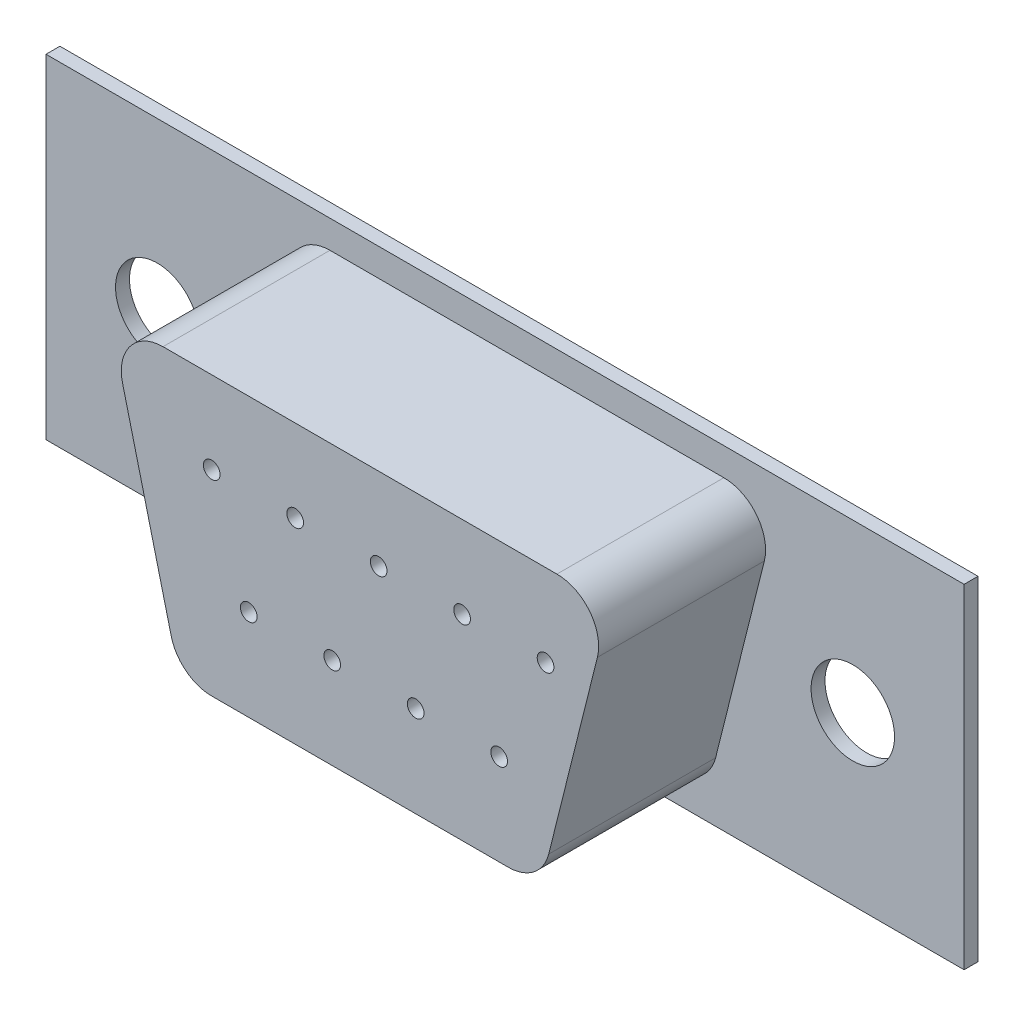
ISO-10303-21;
HEADER;
FILE_DESCRIPTION(('STEP AP214'),'2;1');
FILE_NAME('part.step','',(''),(''),'','','');
FILE_SCHEMA(('AUTOMOTIVE_DESIGN { 1 0 10303 214 1 1 1 1 }'));
ENDSEC;
DATA;
#1=APPLICATION_CONTEXT('core data for automotive mechanical design processes');
#2=APPLICATION_PROTOCOL_DEFINITION('international standard','automotive_design',2000,#1);
#3=PRODUCT_CONTEXT('',#1,'mechanical');
#4=PRODUCT('Part','Part','',(#3));
#5=PRODUCT_RELATED_PRODUCT_CATEGORY('part','',(#4));
#6=PRODUCT_DEFINITION_FORMATION('','',#4);
#7=PRODUCT_DEFINITION_CONTEXT('part definition',#1,'design');
#8=PRODUCT_DEFINITION('design','',#6,#7);
#9=PRODUCT_DEFINITION_SHAPE('','',#8);
#10=(LENGTH_UNIT() NAMED_UNIT(*) SI_UNIT(.MILLI.,.METRE.));
#11=(NAMED_UNIT(*) PLANE_ANGLE_UNIT() SI_UNIT($,.RADIAN.));
#12=(NAMED_UNIT(*) SI_UNIT($,.STERADIAN.) SOLID_ANGLE_UNIT());
#13=UNCERTAINTY_MEASURE_WITH_UNIT(LENGTH_MEASURE(1.E-05),#10,'distance_accuracy_value','');
#14=(GEOMETRIC_REPRESENTATION_CONTEXT(3) GLOBAL_UNCERTAINTY_ASSIGNED_CONTEXT((#13)) GLOBAL_UNIT_ASSIGNED_CONTEXT((#10,
#11,#12)) REPRESENTATION_CONTEXT('',''));
#15=CARTESIAN_POINT('',(0.,0.,0.));
#16=DIRECTION('',(0.,0.,1.));
#17=DIRECTION('',(1.,0.,0.));
#18=AXIS2_PLACEMENT_3D('',#15,#16,#17);
#19=CARTESIAN_POINT('',(-8.21435951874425,5.,6.5));
#20=DIRECTION('',(0.,0.,-1.));
#21=DIRECTION('',(-1.,0.,0.));
#22=AXIS2_PLACEMENT_3D('',#19,#20,#21);
#23=PLANE('',#22);
#24=CARTESIAN_POINT('',(2.78768063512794,-1.72088537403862,6.5));
#25=DIRECTION('',(0.,0.,1.));
#26=DIRECTION('',(1.,0.,0.));
#27=AXIS2_PLACEMENT_3D('',#24,#25,#26);
#28=CIRCLE('',#27,0.3);
#29=CARTESIAN_POINT('',(3.08768063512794,-1.72088537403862,6.5));
#30=VERTEX_POINT('',#29);
#31=EDGE_CURVE('E362',#30,#30,#28,.T.);
#32=ORIENTED_EDGE('',*,*,#31,.F.);
#33=EDGE_LOOP('',(#32));
#34=FACE_BOUND('',#33,.T.);
#35=CARTESIAN_POINT('',(-3.21231936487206,-1.72088537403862,6.5));
#36=DIRECTION('',(0.,0.,1.));
#37=DIRECTION('',(1.,0.,0.));
#38=AXIS2_PLACEMENT_3D('',#35,#36,#37);
#39=CIRCLE('',#38,0.3);
#40=CARTESIAN_POINT('',(-2.91231936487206,-1.72088537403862,6.5));
#41=VERTEX_POINT('',#40);
#42=EDGE_CURVE('E350',#41,#41,#39,.T.);
#43=ORIENTED_EDGE('',*,*,#42,.F.);
#44=EDGE_LOOP('',(#43));
#45=FACE_BOUND('',#44,.T.);
#46=CARTESIAN_POINT('',(4.45686261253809,2.04211731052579,6.5));
#47=DIRECTION('',(0.,0.,1.));
#48=DIRECTION('',(1.,0.,0.));
#49=AXIS2_PLACEMENT_3D('',#46,#47,#48);
#50=CIRCLE('',#49,0.3);
#51=CARTESIAN_POINT('',(4.75686261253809,2.04211731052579,6.5));
#52=VERTEX_POINT('',#51);
#53=EDGE_CURVE('E338',#52,#52,#50,.T.);
#54=ORIENTED_EDGE('',*,*,#53,.F.);
#55=EDGE_LOOP('',(#54));
#56=FACE_BOUND('',#55,.T.);
#57=CARTESIAN_POINT('',(-1.54313738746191,2.04211731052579,6.5));
#58=DIRECTION('',(0.,0.,1.));
#59=DIRECTION('',(1.,0.,0.));
#60=AXIS2_PLACEMENT_3D('',#57,#58,#59);
#61=CIRCLE('',#60,0.3);
#62=CARTESIAN_POINT('',(-1.24313738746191,2.04211731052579,6.5));
#63=VERTEX_POINT('',#62);
#64=EDGE_CURVE('E326',#63,#63,#61,.T.);
#65=ORIENTED_EDGE('',*,*,#64,.F.);
#66=EDGE_LOOP('',(#65));
#67=FACE_BOUND('',#66,.T.);
#68=DIRECTION('',(0.242535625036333,0.970142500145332,0.));
#69=VECTOR('',#68,1.);
#70=CARTESIAN_POINT('',(9.78564048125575,5.,6.5));
#71=LINE('',#70,#69);
#72=CARTESIAN_POINT('',(7.56968962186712,-3.8638034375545,6.5));
#73=VERTEX_POINT('',#72);
#74=CARTESIAN_POINT('',(9.31968962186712,3.1361965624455,6.5));
#75=VERTEX_POINT('',#74);
#76=EDGE_CURVE('E201',#73,#75,#71,.T.);
#77=ORIENTED_EDGE('',*,*,#76,.T.);
#78=CARTESIAN_POINT('',(7.86447587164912,3.5,6.5));
#79=DIRECTION('',(0.,0.,-1.));
#80=DIRECTION('',(-1.,0.,0.));
#81=AXIS2_PLACEMENT_3D('',#78,#79,#80);
#82=CIRCLE('',#81,1.5);
#83=CARTESIAN_POINT('',(7.86447587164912,5.,6.5));
#84=VERTEX_POINT('',#83);
#85=EDGE_CURVE('E166',#75,#84,#82,.F.);
#86=ORIENTED_EDGE('',*,*,#85,.T.);
#87=DIRECTION('',(-1.,0.,0.));
#88=VECTOR('',#87,1.);
#89=CARTESIAN_POINT('',(-8.21435951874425,5.,6.5));
#90=LINE('',#89,#88);
#91=CARTESIAN_POINT('',(-6.29319490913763,5.,6.5));
#92=VERTEX_POINT('',#91);
#93=EDGE_CURVE('E207',#84,#92,#90,.T.);
#94=ORIENTED_EDGE('',*,*,#93,.T.);
#95=CARTESIAN_POINT('',(-6.29319490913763,3.5,6.5));
#96=DIRECTION('',(0.,0.,-1.));
#97=DIRECTION('',(-1.,0.,0.));
#98=AXIS2_PLACEMENT_3D('',#95,#96,#97);
#99=CIRCLE('',#98,1.5);
#100=CARTESIAN_POINT('',(-7.74840865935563,3.1361965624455,6.5));
#101=VERTEX_POINT('',#100);
#102=EDGE_CURVE('E160',#92,#101,#99,.F.);
#103=ORIENTED_EDGE('',*,*,#102,.T.);
#104=DIRECTION('',(0.242535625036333,-0.970142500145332,0.));
#105=VECTOR('',#104,1.);
#106=CARTESIAN_POINT('',(-5.71435951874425,-5.,6.5));
#107=LINE('',#106,#105);
#108=CARTESIAN_POINT('',(-5.99840865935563,-3.8638034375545,6.5));
#109=VERTEX_POINT('',#108);
#110=EDGE_CURVE('E212',#101,#109,#107,.T.);
#111=ORIENTED_EDGE('',*,*,#110,.T.);
#112=CARTESIAN_POINT('',(-4.54319490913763,-3.5,6.5));
#113=DIRECTION('',(0.,0.,-1.));
#114=DIRECTION('',(-1.,0.,0.));
#115=AXIS2_PLACEMENT_3D('',#112,#113,#114);
#116=CIRCLE('',#115,1.5);
#117=CARTESIAN_POINT('',(-4.54319490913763,-5.,6.5));
#118=VERTEX_POINT('',#117);
#119=EDGE_CURVE('E162',#109,#118,#116,.F.);
#120=ORIENTED_EDGE('',*,*,#119,.T.);
#121=DIRECTION('',(1.,0.,0.));
#122=VECTOR('',#121,1.);
#123=CARTESIAN_POINT('',(7.28564048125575,-5.,6.5));
#124=LINE('',#123,#122);
#125=CARTESIAN_POINT('',(6.11447587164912,-5.,6.5));
#126=VERTEX_POINT('',#125);
#127=EDGE_CURVE('E203',#118,#126,#124,.T.);
#128=ORIENTED_EDGE('',*,*,#127,.T.);
#129=CARTESIAN_POINT('',(6.11447587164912,-3.5,6.5));
#130=DIRECTION('',(0.,0.,-1.));
#131=DIRECTION('',(-1.,0.,0.));
#132=AXIS2_PLACEMENT_3D('',#129,#130,#131);
#133=CIRCLE('',#132,1.5);
#134=EDGE_CURVE('E164',#126,#73,#133,.F.);
#135=ORIENTED_EDGE('',*,*,#134,.T.);
#136=EDGE_LOOP('',(#77,#86,#94,#103,#111,#120,#128,#135));
#137=FACE_BOUND('',#136,.T.);
#138=CARTESIAN_POINT('',(-4.54313738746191,2.04211731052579,6.5));
#139=DIRECTION('',(0.,0.,1.));
#140=DIRECTION('',(1.,0.,0.));
#141=AXIS2_PLACEMENT_3D('',#138,#139,#140);
#142=CIRCLE('',#141,0.3);
#143=CARTESIAN_POINT('',(-4.24313738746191,2.04211731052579,6.5));
#144=VERTEX_POINT('',#143);
#145=EDGE_CURVE('E216',#144,#144,#142,.T.);
#146=ORIENTED_EDGE('',*,*,#145,.F.);
#147=EDGE_LOOP('',(#146));
#148=FACE_BOUND('',#147,.T.);
#149=CARTESIAN_POINT('',(1.45686261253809,2.04211731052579,6.5));
#150=DIRECTION('',(0.,0.,1.));
#151=DIRECTION('',(1.,0.,0.));
#152=AXIS2_PLACEMENT_3D('',#149,#150,#151);
#153=CIRCLE('',#152,0.3);
#154=CARTESIAN_POINT('',(1.75686261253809,2.04211731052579,6.5));
#155=VERTEX_POINT('',#154);
#156=EDGE_CURVE('E332',#155,#155,#153,.T.);
#157=ORIENTED_EDGE('',*,*,#156,.F.);
#158=EDGE_LOOP('',(#157));
#159=FACE_BOUND('',#158,.T.);
#160=CARTESIAN_POINT('',(7.45686261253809,2.04211731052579,6.5));
#161=DIRECTION('',(0.,0.,1.));
#162=DIRECTION('',(1.,0.,0.));
#163=AXIS2_PLACEMENT_3D('',#160,#161,#162);
#164=CIRCLE('',#163,0.3);
#165=CARTESIAN_POINT('',(7.75686261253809,2.04211731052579,6.5));
#166=VERTEX_POINT('',#165);
#167=EDGE_CURVE('E344',#166,#166,#164,.T.);
#168=ORIENTED_EDGE('',*,*,#167,.F.);
#169=EDGE_LOOP('',(#168));
#170=FACE_BOUND('',#169,.T.);
#171=CARTESIAN_POINT('',(-0.212319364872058,-1.72088537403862,6.5));
#172=DIRECTION('',(0.,0.,1.));
#173=DIRECTION('',(1.,0.,0.));
#174=AXIS2_PLACEMENT_3D('',#171,#172,#173);
#175=CIRCLE('',#174,0.3);
#176=CARTESIAN_POINT('',(0.0876806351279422,-1.72088537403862,6.5));
#177=VERTEX_POINT('',#176);
#178=EDGE_CURVE('E356',#177,#177,#175,.T.);
#179=ORIENTED_EDGE('',*,*,#178,.F.);
#180=EDGE_LOOP('',(#179));
#181=FACE_BOUND('',#180,.T.);
#182=CARTESIAN_POINT('',(5.78768063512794,-1.72088537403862,6.5));
#183=DIRECTION('',(0.,0.,1.));
#184=DIRECTION('',(1.,0.,0.));
#185=AXIS2_PLACEMENT_3D('',#182,#183,#184);
#186=CIRCLE('',#185,0.3);
#187=CARTESIAN_POINT('',(6.08768063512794,-1.72088537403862,6.5));
#188=VERTEX_POINT('',#187);
#189=EDGE_CURVE('E368',#188,#188,#186,.T.);
#190=ORIENTED_EDGE('',*,*,#189,.F.);
#191=EDGE_LOOP('',(#190));
#192=FACE_BOUND('',#191,.T.);
#193=ADVANCED_FACE('F31',(#34,#45,#56,#67,#137,#148,#159,#170,#181,#192),#23,.F.);
#194=CARTESIAN_POINT('',(16.5,6.,0.5));
#195=DIRECTION('',(0.,0.,-1.));
#196=DIRECTION('',(-1.,0.,0.));
#197=AXIS2_PLACEMENT_3D('',#194,#195,#196);
#198=PLANE('',#197);
#199=CARTESIAN_POINT('',(12.5,0.,0.5));
#200=DIRECTION('',(0.,0.,1.));
#201=DIRECTION('',(1.,0.,0.));
#202=AXIS2_PLACEMENT_3D('',#199,#200,#201);
#203=CIRCLE('',#202,1.5);
#204=CARTESIAN_POINT('',(14.,0.,0.5));
#205=VERTEX_POINT('',#204);
#206=EDGE_CURVE('E222',#205,#205,#203,.T.);
#207=ORIENTED_EDGE('',*,*,#206,.F.);
#208=EDGE_LOOP('',(#207));
#209=FACE_BOUND('',#208,.T.);
#210=DIRECTION('',(0.,1.,0.));
#211=VECTOR('',#210,1.);
#212=CARTESIAN_POINT('',(16.5,-6.,0.5));
#213=LINE('',#212,#211);
#214=CARTESIAN_POINT('',(16.5,-6.,0.5));
#215=VERTEX_POINT('',#214);
#216=CARTESIAN_POINT('',(16.5,6.,0.5));
#217=VERTEX_POINT('',#216);
#218=EDGE_CURVE('E130',#215,#217,#213,.T.);
#219=ORIENTED_EDGE('',*,*,#218,.T.);
#220=DIRECTION('',(-1.,0.,0.));
#221=VECTOR('',#220,1.);
#222=CARTESIAN_POINT('',(-16.5,6.,0.5));
#223=LINE('',#222,#221);
#224=CARTESIAN_POINT('',(-16.5,6.,0.5));
#225=VERTEX_POINT('',#224);
#226=EDGE_CURVE('E119',#217,#225,#223,.T.);
#227=ORIENTED_EDGE('',*,*,#226,.T.);
#228=DIRECTION('',(0.,-1.,0.));
#229=VECTOR('',#228,1.);
#230=CARTESIAN_POINT('',(-16.5,-6.,0.5));
#231=LINE('',#230,#229);
#232=CARTESIAN_POINT('',(-16.5,-6.,0.5));
#233=VERTEX_POINT('',#232);
#234=EDGE_CURVE('E129',#225,#233,#231,.T.);
#235=ORIENTED_EDGE('',*,*,#234,.T.);
#236=DIRECTION('',(1.,0.,0.));
#237=VECTOR('',#236,1.);
#238=CARTESIAN_POINT('',(-16.5,-6.,0.5));
#239=LINE('',#238,#237);
#240=EDGE_CURVE('E136',#233,#215,#239,.T.);
#241=ORIENTED_EDGE('',*,*,#240,.T.);
#242=EDGE_LOOP('',(#219,#227,#235,#241));
#243=FACE_BOUND('',#242,.T.);
#244=CARTESIAN_POINT('',(-12.5,0.,0.5));
#245=DIRECTION('',(0.,0.,1.));
#246=DIRECTION('',(1.,0.,0.));
#247=AXIS2_PLACEMENT_3D('',#244,#245,#246);
#248=CIRCLE('',#247,1.5);
#249=CARTESIAN_POINT('',(-11.,0.,0.5));
#250=VERTEX_POINT('',#249);
#251=EDGE_CURVE('E228',#250,#250,#248,.T.);
#252=ORIENTED_EDGE('',*,*,#251,.F.);
#253=EDGE_LOOP('',(#252));
#254=FACE_BOUND('',#253,.T.);
#255=DIRECTION('',(0.242535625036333,-0.970142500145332,0.));
#256=VECTOR('',#255,1.);
#257=CARTESIAN_POINT('',(-5.71435951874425,-5.,0.5));
#258=LINE('',#257,#256);
#259=CARTESIAN_POINT('',(-7.74840865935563,3.1361965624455,0.5));
#260=VERTEX_POINT('',#259);
#261=CARTESIAN_POINT('',(-5.99840865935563,-3.8638034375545,0.5));
#262=VERTEX_POINT('',#261);
#263=EDGE_CURVE('E193',#260,#262,#258,.T.);
#264=ORIENTED_EDGE('',*,*,#263,.F.);
#265=CARTESIAN_POINT('',(-6.29319490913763,3.5,0.5));
#266=DIRECTION('',(0.,0.,-1.));
#267=DIRECTION('',(-1.,0.,0.));
#268=AXIS2_PLACEMENT_3D('',#265,#266,#267);
#269=CIRCLE('',#268,1.5);
#270=CARTESIAN_POINT('',(-6.29319490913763,5.,0.5));
#271=VERTEX_POINT('',#270);
#272=EDGE_CURVE('E11',#260,#271,#269,.T.);
#273=ORIENTED_EDGE('',*,*,#272,.T.);
#274=DIRECTION('',(-1.,0.,0.));
#275=VECTOR('',#274,1.);
#276=CARTESIAN_POINT('',(-8.21435951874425,5.,0.5));
#277=LINE('',#276,#275);
#278=CARTESIAN_POINT('',(7.86447587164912,5.,0.5));
#279=VERTEX_POINT('',#278);
#280=EDGE_CURVE('E219',#279,#271,#277,.T.);
#281=ORIENTED_EDGE('',*,*,#280,.F.);
#282=CARTESIAN_POINT('',(7.86447587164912,3.5,0.5));
#283=DIRECTION('',(0.,0.,-1.));
#284=DIRECTION('',(-1.,0.,0.));
#285=AXIS2_PLACEMENT_3D('',#282,#283,#284);
#286=CIRCLE('',#285,1.5);
#287=CARTESIAN_POINT('',(9.31968962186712,3.1361965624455,0.5));
#288=VERTEX_POINT('',#287);
#289=EDGE_CURVE('E177',#279,#288,#286,.T.);
#290=ORIENTED_EDGE('',*,*,#289,.T.);
#291=DIRECTION('',(0.242535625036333,0.970142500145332,0.));
#292=VECTOR('',#291,1.);
#293=CARTESIAN_POINT('',(9.78564048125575,5.,0.5));
#294=LINE('',#293,#292);
#295=CARTESIAN_POINT('',(7.56968962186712,-3.8638034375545,0.5));
#296=VERTEX_POINT('',#295);
#297=EDGE_CURVE('E184',#296,#288,#294,.T.);
#298=ORIENTED_EDGE('',*,*,#297,.F.);
#299=CARTESIAN_POINT('',(6.11447587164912,-3.5,0.5));
#300=DIRECTION('',(0.,0.,-1.));
#301=DIRECTION('',(-1.,0.,0.));
#302=AXIS2_PLACEMENT_3D('',#299,#300,#301);
#303=CIRCLE('',#302,1.5);
#304=CARTESIAN_POINT('',(6.11447587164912,-5.,0.5));
#305=VERTEX_POINT('',#304);
#306=EDGE_CURVE('E179',#296,#305,#303,.T.);
#307=ORIENTED_EDGE('',*,*,#306,.T.);
#308=DIRECTION('',(1.,0.,0.));
#309=VECTOR('',#308,1.);
#310=CARTESIAN_POINT('',(7.28564048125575,-5.,0.5));
#311=LINE('',#310,#309);
#312=CARTESIAN_POINT('',(-4.54319490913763,-5.,0.5));
#313=VERTEX_POINT('',#312);
#314=EDGE_CURVE('E182',#313,#305,#311,.T.);
#315=ORIENTED_EDGE('',*,*,#314,.F.);
#316=CARTESIAN_POINT('',(-4.54319490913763,-3.5,0.5));
#317=DIRECTION('',(0.,0.,-1.));
#318=DIRECTION('',(-1.,0.,0.));
#319=AXIS2_PLACEMENT_3D('',#316,#317,#318);
#320=CIRCLE('',#319,1.5);
#321=EDGE_CURVE('E39',#313,#262,#320,.T.);
#322=ORIENTED_EDGE('',*,*,#321,.T.);
#323=EDGE_LOOP('',(#264,#273,#281,#290,#298,#307,#315,#322));
#324=FACE_BOUND('',#323,.T.);
#325=ADVANCED_FACE('F133',(#209,#243,#254,#324),#198,.F.);
#326=CARTESIAN_POINT('',(16.5,6.,0.));
#327=DIRECTION('',(0.,0.,-1.));
#328=DIRECTION('',(-1.,0.,0.));
#329=AXIS2_PLACEMENT_3D('',#326,#327,#328);
#330=PLANE('',#329);
#331=CARTESIAN_POINT('',(-12.5,0.,0.));
#332=DIRECTION('',(0.,0.,1.));
#333=DIRECTION('',(1.,0.,0.));
#334=AXIS2_PLACEMENT_3D('',#331,#332,#333);
#335=CIRCLE('',#334,1.5);
#336=CARTESIAN_POINT('',(-11.,0.,0.));
#337=VERTEX_POINT('',#336);
#338=EDGE_CURVE('E225',#337,#337,#335,.T.);
#339=ORIENTED_EDGE('',*,*,#338,.T.);
#340=EDGE_LOOP('',(#339));
#341=FACE_BOUND('',#340,.T.);
#342=DIRECTION('',(0.,1.,0.));
#343=VECTOR('',#342,1.);
#344=CARTESIAN_POINT('',(16.5,-6.,0.));
#345=LINE('',#344,#343);
#346=CARTESIAN_POINT('',(16.5,-6.,0.));
#347=VERTEX_POINT('',#346);
#348=CARTESIAN_POINT('',(16.5,6.,0.));
#349=VERTEX_POINT('',#348);
#350=EDGE_CURVE('E144',#347,#349,#345,.T.);
#351=ORIENTED_EDGE('',*,*,#350,.F.);
#352=DIRECTION('',(1.,0.,0.));
#353=VECTOR('',#352,1.);
#354=CARTESIAN_POINT('',(-16.5,-6.,0.));
#355=LINE('',#354,#353);
#356=CARTESIAN_POINT('',(-16.5,-6.,0.));
#357=VERTEX_POINT('',#356);
#358=EDGE_CURVE('E140',#357,#347,#355,.T.);
#359=ORIENTED_EDGE('',*,*,#358,.F.);
#360=DIRECTION('',(0.,-1.,0.));
#361=VECTOR('',#360,1.);
#362=CARTESIAN_POINT('',(-16.5,-6.,0.));
#363=LINE('',#362,#361);
#364=CARTESIAN_POINT('',(-16.5,6.,0.));
#365=VERTEX_POINT('',#364);
#366=EDGE_CURVE('E239',#365,#357,#363,.T.);
#367=ORIENTED_EDGE('',*,*,#366,.F.);
#368=DIRECTION('',(-1.,0.,0.));
#369=VECTOR('',#368,1.);
#370=CARTESIAN_POINT('',(-16.5,6.,0.));
#371=LINE('',#370,#369);
#372=EDGE_CURVE('E237',#349,#365,#371,.T.);
#373=ORIENTED_EDGE('',*,*,#372,.F.);
#374=EDGE_LOOP('',(#351,#359,#367,#373));
#375=FACE_BOUND('',#374,.T.);
#376=CARTESIAN_POINT('',(12.5,0.,0.));
#377=DIRECTION('',(0.,0.,1.));
#378=DIRECTION('',(1.,0.,0.));
#379=AXIS2_PLACEMENT_3D('',#376,#377,#378);
#380=CIRCLE('',#379,1.5);
#381=CARTESIAN_POINT('',(14.,0.,0.));
#382=VERTEX_POINT('',#381);
#383=EDGE_CURVE('E210',#382,#382,#380,.T.);
#384=ORIENTED_EDGE('',*,*,#383,.T.);
#385=EDGE_LOOP('',(#384));
#386=FACE_BOUND('',#385,.T.);
#387=ADVANCED_FACE('F250',(#341,#375,#386),#330,.T.);
#388=CARTESIAN_POINT('',(16.5,-6.,0.5));
#389=DIRECTION('',(-1.,0.,0.));
#390=DIRECTION('',(0.,0.,1.));
#391=AXIS2_PLACEMENT_3D('',#388,#389,#390);
#392=PLANE('',#391);
#393=ORIENTED_EDGE('',*,*,#350,.T.);
#394=DIRECTION('',(0.,0.,-1.));
#395=VECTOR('',#394,1.);
#396=CARTESIAN_POINT('',(16.5,6.,0.5));
#397=LINE('',#396,#395);
#398=EDGE_CURVE('E123',#217,#349,#397,.T.);
#399=ORIENTED_EDGE('',*,*,#398,.F.);
#400=ORIENTED_EDGE('',*,*,#218,.F.);
#401=DIRECTION('',(0.,0.,-1.));
#402=VECTOR('',#401,1.);
#403=CARTESIAN_POINT('',(16.5,-6.,0.5));
#404=LINE('',#403,#402);
#405=EDGE_CURVE('E235',#215,#347,#404,.T.);
#406=ORIENTED_EDGE('',*,*,#405,.T.);
#407=EDGE_LOOP('',(#393,#399,#400,#406));
#408=FACE_BOUND('',#407,.T.);
#409=ADVANCED_FACE('F142',(#408),#392,.F.);
#410=CARTESIAN_POINT('',(-16.5,6.,0.5));
#411=DIRECTION('',(0.,-1.,0.));
#412=DIRECTION('',(0.,0.,-1.));
#413=AXIS2_PLACEMENT_3D('',#410,#411,#412);
#414=PLANE('',#413);
#415=ORIENTED_EDGE('',*,*,#372,.T.);
#416=DIRECTION('',(0.,0.,-1.));
#417=VECTOR('',#416,1.);
#418=CARTESIAN_POINT('',(-16.5,6.,0.5));
#419=LINE('',#418,#417);
#420=EDGE_CURVE('E126',#225,#365,#419,.T.);
#421=ORIENTED_EDGE('',*,*,#420,.F.);
#422=ORIENTED_EDGE('',*,*,#226,.F.);
#423=ORIENTED_EDGE('',*,*,#398,.T.);
#424=EDGE_LOOP('',(#415,#421,#422,#423));
#425=FACE_BOUND('',#424,.T.);
#426=ADVANCED_FACE('F121',(#425),#414,.F.);
#427=CARTESIAN_POINT('',(-16.5,-6.,0.5));
#428=DIRECTION('',(1.,0.,0.));
#429=DIRECTION('',(0.,0.,-1.));
#430=AXIS2_PLACEMENT_3D('',#427,#428,#429);
#431=PLANE('',#430);
#432=ORIENTED_EDGE('',*,*,#366,.T.);
#433=DIRECTION('',(0.,0.,-1.));
#434=VECTOR('',#433,1.);
#435=CARTESIAN_POINT('',(-16.5,-6.,0.5));
#436=LINE('',#435,#434);
#437=EDGE_CURVE('E149',#233,#357,#436,.T.);
#438=ORIENTED_EDGE('',*,*,#437,.F.);
#439=ORIENTED_EDGE('',*,*,#234,.F.);
#440=ORIENTED_EDGE('',*,*,#420,.T.);
#441=EDGE_LOOP('',(#432,#438,#439,#440));
#442=FACE_BOUND('',#441,.T.);
#443=ADVANCED_FACE('F252',(#442),#431,.F.);
#444=CARTESIAN_POINT('',(-16.5,-6.,0.5));
#445=DIRECTION('',(0.,1.,0.));
#446=DIRECTION('',(0.,0.,1.));
#447=AXIS2_PLACEMENT_3D('',#444,#445,#446);
#448=PLANE('',#447);
#449=ORIENTED_EDGE('',*,*,#358,.T.);
#450=ORIENTED_EDGE('',*,*,#405,.F.);
#451=ORIENTED_EDGE('',*,*,#240,.F.);
#452=ORIENTED_EDGE('',*,*,#437,.T.);
#453=EDGE_LOOP('',(#449,#450,#451,#452));
#454=FACE_BOUND('',#453,.T.);
#455=ADVANCED_FACE('F246',(#454),#448,.F.);
#456=CARTESIAN_POINT('',(-12.5,0.,0.5));
#457=DIRECTION('',(0.,0.,-1.));
#458=DIRECTION('',(-1.,0.,0.));
#459=AXIS2_PLACEMENT_3D('',#456,#457,#458);
#460=CYLINDRICAL_SURFACE('',#459,1.5);
#461=ORIENTED_EDGE('',*,*,#251,.T.);
#462=EDGE_LOOP('',(#461));
#463=FACE_BOUND('',#462,.T.);
#464=ORIENTED_EDGE('',*,*,#338,.F.);
#465=EDGE_LOOP('',(#464));
#466=FACE_BOUND('',#465,.T.);
#467=ADVANCED_FACE('F259',(#463,#466),#460,.F.);
#468=CARTESIAN_POINT('',(12.5,0.,0.5));
#469=DIRECTION('',(0.,0.,-1.));
#470=DIRECTION('',(-1.,0.,0.));
#471=AXIS2_PLACEMENT_3D('',#468,#469,#470);
#472=CYLINDRICAL_SURFACE('',#471,1.5);
#473=ORIENTED_EDGE('',*,*,#206,.T.);
#474=EDGE_LOOP('',(#473));
#475=FACE_BOUND('',#474,.T.);
#476=ORIENTED_EDGE('',*,*,#383,.F.);
#477=EDGE_LOOP('',(#476));
#478=FACE_BOUND('',#477,.T.);
#479=ADVANCED_FACE('F288',(#475,#478),#472,.F.);
#480=CARTESIAN_POINT('',(-5.71435951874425,-5.,6.5));
#481=DIRECTION('',(0.970142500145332,0.242535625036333,0.));
#482=DIRECTION('',(-0.242535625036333,0.970142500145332,0.));
#483=AXIS2_PLACEMENT_3D('',#480,#481,#482);
#484=PLANE('',#483);
#485=ORIENTED_EDGE('',*,*,#263,.T.);
#486=DIRECTION('',(0.,0.,-1.));
#487=VECTOR('',#486,1.);
#488=CARTESIAN_POINT('',(-5.99840865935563,-3.8638034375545,6.5));
#489=LINE('',#488,#487);
#490=EDGE_CURVE('E175',#262,#109,#489,.F.);
#491=ORIENTED_EDGE('',*,*,#490,.T.);
#492=ORIENTED_EDGE('',*,*,#110,.F.);
#493=DIRECTION('',(0.,0.,-1.));
#494=VECTOR('',#493,1.);
#495=CARTESIAN_POINT('',(-7.74840865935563,3.1361965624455,6.5));
#496=LINE('',#495,#494);
#497=EDGE_CURVE('E173',#101,#260,#496,.T.);
#498=ORIENTED_EDGE('',*,*,#497,.T.);
#499=EDGE_LOOP('',(#485,#491,#492,#498));
#500=FACE_BOUND('',#499,.T.);
#501=ADVANCED_FACE('F285',(#500),#484,.F.);
#502=CARTESIAN_POINT('',(7.28564048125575,-5.,6.5));
#503=DIRECTION('',(0.,1.,0.));
#504=DIRECTION('',(-1.,0.,0.));
#505=AXIS2_PLACEMENT_3D('',#502,#503,#504);
#506=PLANE('',#505);
#507=ORIENTED_EDGE('',*,*,#314,.T.);
#508=DIRECTION('',(0.,0.,-1.));
#509=VECTOR('',#508,1.);
#510=CARTESIAN_POINT('',(6.11447587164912,-5.,6.5));
#511=LINE('',#510,#509);
#512=EDGE_CURVE('E171',#305,#126,#511,.F.);
#513=ORIENTED_EDGE('',*,*,#512,.T.);
#514=ORIENTED_EDGE('',*,*,#127,.F.);
#515=DIRECTION('',(0.,0.,-1.));
#516=VECTOR('',#515,1.);
#517=CARTESIAN_POINT('',(-4.54319490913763,-5.,6.5));
#518=LINE('',#517,#516);
#519=EDGE_CURVE('E168',#118,#313,#518,.T.);
#520=ORIENTED_EDGE('',*,*,#519,.T.);
#521=EDGE_LOOP('',(#507,#513,#514,#520));
#522=FACE_BOUND('',#521,.T.);
#523=ADVANCED_FACE('F189',(#522),#506,.F.);
#524=CARTESIAN_POINT('',(9.78564048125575,5.,6.5));
#525=DIRECTION('',(-0.970142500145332,0.242535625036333,0.));
#526=DIRECTION('',(-0.242535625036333,-0.970142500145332,0.));
#527=AXIS2_PLACEMENT_3D('',#524,#525,#526);
#528=PLANE('',#527);
#529=ORIENTED_EDGE('',*,*,#297,.T.);
#530=DIRECTION('',(0.,0.,-1.));
#531=VECTOR('',#530,1.);
#532=CARTESIAN_POINT('',(9.31968962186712,3.1361965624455,6.5));
#533=LINE('',#532,#531);
#534=EDGE_CURVE('E158',#288,#75,#533,.F.);
#535=ORIENTED_EDGE('',*,*,#534,.T.);
#536=ORIENTED_EDGE('',*,*,#76,.F.);
#537=DIRECTION('',(0.,0.,-1.));
#538=VECTOR('',#537,1.);
#539=CARTESIAN_POINT('',(7.56968962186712,-3.8638034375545,6.5));
#540=LINE('',#539,#538);
#541=EDGE_CURVE('E155',#73,#296,#540,.T.);
#542=ORIENTED_EDGE('',*,*,#541,.T.);
#543=EDGE_LOOP('',(#529,#535,#536,#542));
#544=FACE_BOUND('',#543,.T.);
#545=ADVANCED_FACE('F205',(#544),#528,.F.);
#546=CARTESIAN_POINT('',(-8.21435951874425,5.,6.5));
#547=DIRECTION('',(0.,-1.,0.));
#548=DIRECTION('',(0.,0.,-1.));
#549=AXIS2_PLACEMENT_3D('',#546,#547,#548);
#550=PLANE('',#549);
#551=ORIENTED_EDGE('',*,*,#93,.F.);
#552=DIRECTION('',(0.,0.,-1.));
#553=VECTOR('',#552,1.);
#554=CARTESIAN_POINT('',(7.86447587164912,5.,6.5));
#555=LINE('',#554,#553);
#556=EDGE_CURVE('E147',#84,#279,#555,.T.);
#557=ORIENTED_EDGE('',*,*,#556,.T.);
#558=ORIENTED_EDGE('',*,*,#280,.T.);
#559=DIRECTION('',(0.,0.,-1.));
#560=VECTOR('',#559,1.);
#561=CARTESIAN_POINT('',(-6.29319490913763,5.,6.5));
#562=LINE('',#561,#560);
#563=EDGE_CURVE('E145',#271,#92,#562,.F.);
#564=ORIENTED_EDGE('',*,*,#563,.T.);
#565=EDGE_LOOP('',(#551,#557,#558,#564));
#566=FACE_BOUND('',#565,.T.);
#567=ADVANCED_FACE('F276',(#566),#550,.F.);
#568=CARTESIAN_POINT('',(7.86447587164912,3.5,6.5));
#569=DIRECTION('',(0.,0.,-1.));
#570=DIRECTION('',(-1.,0.,0.));
#571=AXIS2_PLACEMENT_3D('',#568,#569,#570);
#572=CYLINDRICAL_SURFACE('',#571,1.5);
#573=ORIENTED_EDGE('',*,*,#85,.F.);
#574=ORIENTED_EDGE('',*,*,#534,.F.);
#575=ORIENTED_EDGE('',*,*,#289,.F.);
#576=ORIENTED_EDGE('',*,*,#556,.F.);
#577=EDGE_LOOP('',(#573,#574,#575,#576));
#578=FACE_BOUND('',#577,.T.);
#579=ADVANCED_FACE('F279',(#578),#572,.T.);
#580=CARTESIAN_POINT('',(6.11447587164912,-3.5,6.5));
#581=DIRECTION('',(0.,0.,-1.));
#582=DIRECTION('',(-1.,0.,0.));
#583=AXIS2_PLACEMENT_3D('',#580,#581,#582);
#584=CYLINDRICAL_SURFACE('',#583,1.5);
#585=ORIENTED_EDGE('',*,*,#134,.F.);
#586=ORIENTED_EDGE('',*,*,#512,.F.);
#587=ORIENTED_EDGE('',*,*,#306,.F.);
#588=ORIENTED_EDGE('',*,*,#541,.F.);
#589=EDGE_LOOP('',(#585,#586,#587,#588));
#590=FACE_BOUND('',#589,.T.);
#591=ADVANCED_FACE('F196',(#590),#584,.T.);
#592=CARTESIAN_POINT('',(-4.54319490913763,-3.5,6.5));
#593=DIRECTION('',(0.,0.,-1.));
#594=DIRECTION('',(-1.,0.,0.));
#595=AXIS2_PLACEMENT_3D('',#592,#593,#594);
#596=CYLINDRICAL_SURFACE('',#595,1.5);
#597=ORIENTED_EDGE('',*,*,#119,.F.);
#598=ORIENTED_EDGE('',*,*,#490,.F.);
#599=ORIENTED_EDGE('',*,*,#321,.F.);
#600=ORIENTED_EDGE('',*,*,#519,.F.);
#601=EDGE_LOOP('',(#597,#598,#599,#600));
#602=FACE_BOUND('',#601,.T.);
#603=ADVANCED_FACE('F311',(#602),#596,.T.);
#604=CARTESIAN_POINT('',(-6.29319490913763,3.5,6.5));
#605=DIRECTION('',(0.,0.,-1.));
#606=DIRECTION('',(-1.,0.,0.));
#607=AXIS2_PLACEMENT_3D('',#604,#605,#606);
#608=CYLINDRICAL_SURFACE('',#607,1.5);
#609=ORIENTED_EDGE('',*,*,#102,.F.);
#610=ORIENTED_EDGE('',*,*,#563,.F.);
#611=ORIENTED_EDGE('',*,*,#272,.F.);
#612=ORIENTED_EDGE('',*,*,#497,.F.);
#613=EDGE_LOOP('',(#609,#610,#611,#612));
#614=FACE_BOUND('',#613,.T.);
#615=ADVANCED_FACE('F33',(#614),#608,.T.);
#616=CARTESIAN_POINT('',(-4.54313738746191,2.04211731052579,6.5));
#617=DIRECTION('',(0.,0.,-1.));
#618=DIRECTION('',(-1.,0.,0.));
#619=AXIS2_PLACEMENT_3D('',#616,#617,#618);
#620=CYLINDRICAL_SURFACE('',#619,0.3);
#621=ORIENTED_EDGE('',*,*,#145,.T.);
#622=EDGE_LOOP('',(#621));
#623=FACE_BOUND('',#622,.T.);
#624=CARTESIAN_POINT('',(-4.54313738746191,2.04211731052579,0.5));
#625=DIRECTION('',(0.,0.,1.));
#626=DIRECTION('',(1.,0.,0.));
#627=AXIS2_PLACEMENT_3D('',#624,#625,#626);
#628=CIRCLE('',#627,0.3);
#629=CARTESIAN_POINT('',(-4.24313738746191,2.04211731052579,0.5));
#630=VERTEX_POINT('',#629);
#631=EDGE_CURVE('E323',#630,#630,#628,.T.);
#632=ORIENTED_EDGE('',*,*,#631,.F.);
#633=EDGE_LOOP('',(#632));
#634=FACE_BOUND('',#633,.T.);
#635=ADVANCED_FACE('F274',(#623,#634),#620,.F.);
#636=CARTESIAN_POINT('',(-4.54313738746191,2.04211731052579,0.5));
#637=DIRECTION('',(0.,0.,1.));
#638=DIRECTION('',(1.,0.,0.));
#639=AXIS2_PLACEMENT_3D('',#636,#637,#638);
#640=PLANE('',#639);
#641=ORIENTED_EDGE('',*,*,#631,.T.);
#642=EDGE_LOOP('',(#641));
#643=FACE_BOUND('',#642,.T.);
#644=ADVANCED_FACE('F444',(#643),#640,.T.);
#645=CARTESIAN_POINT('',(-1.54313738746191,2.04211731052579,6.5));
#646=DIRECTION('',(0.,0.,-1.));
#647=DIRECTION('',(-1.,0.,0.));
#648=AXIS2_PLACEMENT_3D('',#645,#646,#647);
#649=CYLINDRICAL_SURFACE('',#648,0.3);
#650=ORIENTED_EDGE('',*,*,#64,.T.);
#651=EDGE_LOOP('',(#650));
#652=FACE_BOUND('',#651,.T.);
#653=CARTESIAN_POINT('',(-1.54313738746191,2.04211731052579,0.5));
#654=DIRECTION('',(0.,0.,1.));
#655=DIRECTION('',(1.,0.,0.));
#656=AXIS2_PLACEMENT_3D('',#653,#654,#655);
#657=CIRCLE('',#656,0.3);
#658=CARTESIAN_POINT('',(-1.24313738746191,2.04211731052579,0.5));
#659=VERTEX_POINT('',#658);
#660=EDGE_CURVE('E329',#659,#659,#657,.T.);
#661=ORIENTED_EDGE('',*,*,#660,.F.);
#662=EDGE_LOOP('',(#661));
#663=FACE_BOUND('',#662,.T.);
#664=ADVANCED_FACE('F441',(#652,#663),#649,.F.);
#665=CARTESIAN_POINT('',(-1.54313738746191,2.04211731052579,0.5));
#666=DIRECTION('',(0.,0.,1.));
#667=DIRECTION('',(1.,0.,0.));
#668=AXIS2_PLACEMENT_3D('',#665,#666,#667);
#669=PLANE('',#668);
#670=ORIENTED_EDGE('',*,*,#660,.T.);
#671=EDGE_LOOP('',(#670));
#672=FACE_BOUND('',#671,.T.);
#673=ADVANCED_FACE('F437',(#672),#669,.T.);
#674=CARTESIAN_POINT('',(1.45686261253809,2.04211731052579,6.5));
#675=DIRECTION('',(0.,0.,-1.));
#676=DIRECTION('',(-1.,0.,0.));
#677=AXIS2_PLACEMENT_3D('',#674,#675,#676);
#678=CYLINDRICAL_SURFACE('',#677,0.3);
#679=ORIENTED_EDGE('',*,*,#156,.T.);
#680=EDGE_LOOP('',(#679));
#681=FACE_BOUND('',#680,.T.);
#682=CARTESIAN_POINT('',(1.45686261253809,2.04211731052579,0.5));
#683=DIRECTION('',(0.,0.,1.));
#684=DIRECTION('',(1.,0.,0.));
#685=AXIS2_PLACEMENT_3D('',#682,#683,#684);
#686=CIRCLE('',#685,0.3);
#687=CARTESIAN_POINT('',(1.75686261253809,2.04211731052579,0.5));
#688=VERTEX_POINT('',#687);
#689=EDGE_CURVE('E335',#688,#688,#686,.T.);
#690=ORIENTED_EDGE('',*,*,#689,.F.);
#691=EDGE_LOOP('',(#690));
#692=FACE_BOUND('',#691,.T.);
#693=ADVANCED_FACE('F433',(#681,#692),#678,.F.);
#694=CARTESIAN_POINT('',(1.45686261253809,2.04211731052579,0.5));
#695=DIRECTION('',(0.,0.,1.));
#696=DIRECTION('',(1.,0.,0.));
#697=AXIS2_PLACEMENT_3D('',#694,#695,#696);
#698=PLANE('',#697);
#699=ORIENTED_EDGE('',*,*,#689,.T.);
#700=EDGE_LOOP('',(#699));
#701=FACE_BOUND('',#700,.T.);
#702=ADVANCED_FACE('F429',(#701),#698,.T.);
#703=CARTESIAN_POINT('',(4.45686261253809,2.04211731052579,6.5));
#704=DIRECTION('',(0.,0.,-1.));
#705=DIRECTION('',(-1.,0.,0.));
#706=AXIS2_PLACEMENT_3D('',#703,#704,#705);
#707=CYLINDRICAL_SURFACE('',#706,0.3);
#708=ORIENTED_EDGE('',*,*,#53,.T.);
#709=EDGE_LOOP('',(#708));
#710=FACE_BOUND('',#709,.T.);
#711=CARTESIAN_POINT('',(4.45686261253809,2.04211731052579,0.5));
#712=DIRECTION('',(0.,0.,1.));
#713=DIRECTION('',(1.,0.,0.));
#714=AXIS2_PLACEMENT_3D('',#711,#712,#713);
#715=CIRCLE('',#714,0.3);
#716=CARTESIAN_POINT('',(4.75686261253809,2.04211731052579,0.5));
#717=VERTEX_POINT('',#716);
#718=EDGE_CURVE('E341',#717,#717,#715,.T.);
#719=ORIENTED_EDGE('',*,*,#718,.F.);
#720=EDGE_LOOP('',(#719));
#721=FACE_BOUND('',#720,.T.);
#722=ADVANCED_FACE('F425',(#710,#721),#707,.F.);
#723=CARTESIAN_POINT('',(4.45686261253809,2.04211731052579,0.5));
#724=DIRECTION('',(0.,0.,1.));
#725=DIRECTION('',(1.,0.,0.));
#726=AXIS2_PLACEMENT_3D('',#723,#724,#725);
#727=PLANE('',#726);
#728=ORIENTED_EDGE('',*,*,#718,.T.);
#729=EDGE_LOOP('',(#728));
#730=FACE_BOUND('',#729,.T.);
#731=ADVANCED_FACE('F421',(#730),#727,.T.);
#732=CARTESIAN_POINT('',(7.45686261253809,2.04211731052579,6.5));
#733=DIRECTION('',(0.,0.,-1.));
#734=DIRECTION('',(-1.,0.,0.));
#735=AXIS2_PLACEMENT_3D('',#732,#733,#734);
#736=CYLINDRICAL_SURFACE('',#735,0.3);
#737=ORIENTED_EDGE('',*,*,#167,.T.);
#738=EDGE_LOOP('',(#737));
#739=FACE_BOUND('',#738,.T.);
#740=CARTESIAN_POINT('',(7.45686261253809,2.04211731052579,0.5));
#741=DIRECTION('',(0.,0.,1.));
#742=DIRECTION('',(1.,0.,0.));
#743=AXIS2_PLACEMENT_3D('',#740,#741,#742);
#744=CIRCLE('',#743,0.3);
#745=CARTESIAN_POINT('',(7.75686261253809,2.04211731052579,0.5));
#746=VERTEX_POINT('',#745);
#747=EDGE_CURVE('E347',#746,#746,#744,.T.);
#748=ORIENTED_EDGE('',*,*,#747,.F.);
#749=EDGE_LOOP('',(#748));
#750=FACE_BOUND('',#749,.T.);
#751=ADVANCED_FACE('F417',(#739,#750),#736,.F.);
#752=CARTESIAN_POINT('',(7.45686261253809,2.04211731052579,0.5));
#753=DIRECTION('',(0.,0.,1.));
#754=DIRECTION('',(1.,0.,0.));
#755=AXIS2_PLACEMENT_3D('',#752,#753,#754);
#756=PLANE('',#755);
#757=ORIENTED_EDGE('',*,*,#747,.T.);
#758=EDGE_LOOP('',(#757));
#759=FACE_BOUND('',#758,.T.);
#760=ADVANCED_FACE('F413',(#759),#756,.T.);
#761=CARTESIAN_POINT('',(-3.21231936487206,-1.72088537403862,6.5));
#762=DIRECTION('',(0.,0.,-1.));
#763=DIRECTION('',(-1.,0.,0.));
#764=AXIS2_PLACEMENT_3D('',#761,#762,#763);
#765=CYLINDRICAL_SURFACE('',#764,0.3);
#766=ORIENTED_EDGE('',*,*,#42,.T.);
#767=EDGE_LOOP('',(#766));
#768=FACE_BOUND('',#767,.T.);
#769=CARTESIAN_POINT('',(-3.21231936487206,-1.72088537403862,0.5));
#770=DIRECTION('',(0.,0.,1.));
#771=DIRECTION('',(1.,0.,0.));
#772=AXIS2_PLACEMENT_3D('',#769,#770,#771);
#773=CIRCLE('',#772,0.3);
#774=CARTESIAN_POINT('',(-2.91231936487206,-1.72088537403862,0.5));
#775=VERTEX_POINT('',#774);
#776=EDGE_CURVE('E353',#775,#775,#773,.T.);
#777=ORIENTED_EDGE('',*,*,#776,.F.);
#778=EDGE_LOOP('',(#777));
#779=FACE_BOUND('',#778,.T.);
#780=ADVANCED_FACE('F409',(#768,#779),#765,.F.);
#781=CARTESIAN_POINT('',(-3.21231936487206,-1.72088537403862,0.5));
#782=DIRECTION('',(0.,0.,1.));
#783=DIRECTION('',(1.,0.,0.));
#784=AXIS2_PLACEMENT_3D('',#781,#782,#783);
#785=PLANE('',#784);
#786=ORIENTED_EDGE('',*,*,#776,.T.);
#787=EDGE_LOOP('',(#786));
#788=FACE_BOUND('',#787,.T.);
#789=ADVANCED_FACE('F405',(#788),#785,.T.);
#790=CARTESIAN_POINT('',(-0.212319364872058,-1.72088537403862,6.5));
#791=DIRECTION('',(0.,0.,-1.));
#792=DIRECTION('',(-1.,0.,0.));
#793=AXIS2_PLACEMENT_3D('',#790,#791,#792);
#794=CYLINDRICAL_SURFACE('',#793,0.3);
#795=ORIENTED_EDGE('',*,*,#178,.T.);
#796=EDGE_LOOP('',(#795));
#797=FACE_BOUND('',#796,.T.);
#798=CARTESIAN_POINT('',(-0.212319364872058,-1.72088537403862,0.5));
#799=DIRECTION('',(0.,0.,1.));
#800=DIRECTION('',(1.,0.,0.));
#801=AXIS2_PLACEMENT_3D('',#798,#799,#800);
#802=CIRCLE('',#801,0.3);
#803=CARTESIAN_POINT('',(0.0876806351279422,-1.72088537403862,0.5));
#804=VERTEX_POINT('',#803);
#805=EDGE_CURVE('E359',#804,#804,#802,.T.);
#806=ORIENTED_EDGE('',*,*,#805,.F.);
#807=EDGE_LOOP('',(#806));
#808=FACE_BOUND('',#807,.T.);
#809=ADVANCED_FACE('F401',(#797,#808),#794,.F.);
#810=CARTESIAN_POINT('',(-0.212319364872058,-1.72088537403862,0.5));
#811=DIRECTION('',(0.,0.,1.));
#812=DIRECTION('',(1.,0.,0.));
#813=AXIS2_PLACEMENT_3D('',#810,#811,#812);
#814=PLANE('',#813);
#815=ORIENTED_EDGE('',*,*,#805,.T.);
#816=EDGE_LOOP('',(#815));
#817=FACE_BOUND('',#816,.T.);
#818=ADVANCED_FACE('F397',(#817),#814,.T.);
#819=CARTESIAN_POINT('',(2.78768063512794,-1.72088537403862,6.5));
#820=DIRECTION('',(0.,0.,-1.));
#821=DIRECTION('',(-1.,0.,0.));
#822=AXIS2_PLACEMENT_3D('',#819,#820,#821);
#823=CYLINDRICAL_SURFACE('',#822,0.3);
#824=ORIENTED_EDGE('',*,*,#31,.T.);
#825=EDGE_LOOP('',(#824));
#826=FACE_BOUND('',#825,.T.);
#827=CARTESIAN_POINT('',(2.78768063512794,-1.72088537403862,0.5));
#828=DIRECTION('',(0.,0.,1.));
#829=DIRECTION('',(1.,0.,0.));
#830=AXIS2_PLACEMENT_3D('',#827,#828,#829);
#831=CIRCLE('',#830,0.3);
#832=CARTESIAN_POINT('',(3.08768063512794,-1.72088537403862,0.5));
#833=VERTEX_POINT('',#832);
#834=EDGE_CURVE('E365',#833,#833,#831,.T.);
#835=ORIENTED_EDGE('',*,*,#834,.F.);
#836=EDGE_LOOP('',(#835));
#837=FACE_BOUND('',#836,.T.);
#838=ADVANCED_FACE('F393',(#826,#837),#823,.F.);
#839=CARTESIAN_POINT('',(2.78768063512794,-1.72088537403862,0.5));
#840=DIRECTION('',(0.,0.,1.));
#841=DIRECTION('',(1.,0.,0.));
#842=AXIS2_PLACEMENT_3D('',#839,#840,#841);
#843=PLANE('',#842);
#844=ORIENTED_EDGE('',*,*,#834,.T.);
#845=EDGE_LOOP('',(#844));
#846=FACE_BOUND('',#845,.T.);
#847=ADVANCED_FACE('F382',(#846),#843,.T.);
#848=CARTESIAN_POINT('',(5.78768063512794,-1.72088537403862,6.5));
#849=DIRECTION('',(0.,0.,-1.));
#850=DIRECTION('',(-1.,0.,0.));
#851=AXIS2_PLACEMENT_3D('',#848,#849,#850);
#852=CYLINDRICAL_SURFACE('',#851,0.3);
#853=ORIENTED_EDGE('',*,*,#189,.T.);
#854=EDGE_LOOP('',(#853));
#855=FACE_BOUND('',#854,.T.);
#856=CARTESIAN_POINT('',(5.78768063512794,-1.72088537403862,0.5));
#857=DIRECTION('',(0.,0.,1.));
#858=DIRECTION('',(1.,0.,0.));
#859=AXIS2_PLACEMENT_3D('',#856,#857,#858);
#860=CIRCLE('',#859,0.3);
#861=CARTESIAN_POINT('',(6.08768063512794,-1.72088537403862,0.5));
#862=VERTEX_POINT('',#861);
#863=EDGE_CURVE('E371',#862,#862,#860,.T.);
#864=ORIENTED_EDGE('',*,*,#863,.F.);
#865=EDGE_LOOP('',(#864));
#866=FACE_BOUND('',#865,.T.);
#867=ADVANCED_FACE('F377',(#855,#866),#852,.F.);
#868=CARTESIAN_POINT('',(5.78768063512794,-1.72088537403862,0.5));
#869=DIRECTION('',(0.,0.,1.));
#870=DIRECTION('',(1.,0.,0.));
#871=AXIS2_PLACEMENT_3D('',#868,#869,#870);
#872=PLANE('',#871);
#873=ORIENTED_EDGE('',*,*,#863,.T.);
#874=EDGE_LOOP('',(#873));
#875=FACE_BOUND('',#874,.T.);
#876=ADVANCED_FACE('F381',(#875),#872,.T.);
#877=CLOSED_SHELL('',(#193,#325,#387,#409,#426,#443,#455,#467,#479,#501,#523,#545,#567,#579,
#591,#603,#615,#635,#644,#664,#673,#693,#702,#722,#731,#751,#760,#780,#789,#809,#818,#838,#847,
#867,#876));
#878=MANIFOLD_SOLID_BREP('B2',#877);
#879=ADVANCED_BREP_SHAPE_REPRESENTATION('',(#18,#878),#14);
#880=SHAPE_DEFINITION_REPRESENTATION(#9,#879);
ENDSEC;
END-ISO-10303-21;
